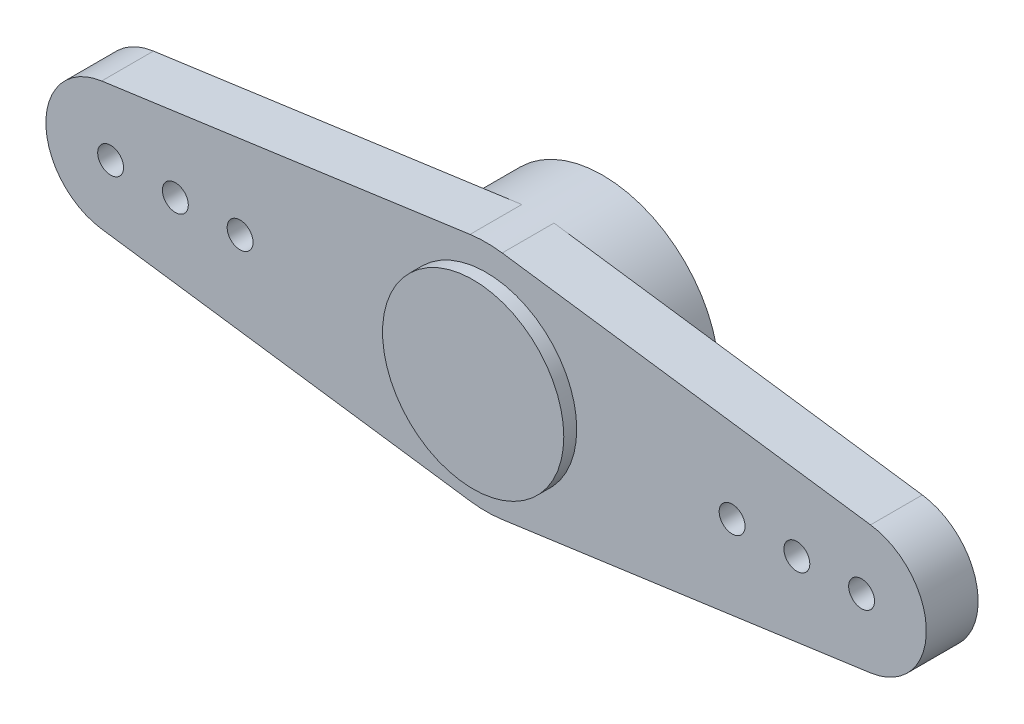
from build123d import *

# Parameters (mm, degrees)
ESQUISSE1_R      = 0.5
EXTRUSION6_DEPTH = 2
ESQUISSE2_R      = 3.5
EXTRUSION7_DEPTH = 0.5
EXTRUSION8_START = 2.5
ESQUISSE3_R      = 4.5
EXTRUSION8_DEPTH = 2.5
ESQUISSE4_R      = 2.9
EXTRUSION9_DEPTH = 2.7


with BuildPart() as part:
    # Esquisse1 → Extrusion6 (new body)
    with BuildSketch(Plane.XY):
        with BuildLine():
            Line((-14.844827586, 2.476104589), (-0.620689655, 4.45698826))
            ThreePointArc((-0.620689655, 4.45698826), (0, 4.5), (0.620689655, 4.45698826))
            Line((0.620689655, 4.45698826), (14.844827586, 2.476104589))
            ThreePointArc((14.844827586, 2.476104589), (17, 0), (14.844827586, -2.476104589))
            Line((14.844827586, -2.476104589), (0.620689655, -4.45698826))
            ThreePointArc((0.620689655, -4.45698826), (0, -4.5), (-0.620689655, -4.45698826))
            Line((-0.620689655, -4.45698826), (-14.844827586, -2.476104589))
            ThreePointArc((-14.844827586, -2.476104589), (-17, 0), (-14.844827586, 2.476104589))
        make_face()
        with Locations((-14.5, 0)):
            Circle(ESQUISSE1_R, mode=Mode.SUBTRACT)
        with Locations((-12, 0)):
            Circle(ESQUISSE1_R, mode=Mode.SUBTRACT)
        with Locations((-9.5, 0)):
            Circle(ESQUISSE1_R, mode=Mode.SUBTRACT)
        with Locations((9.5, 0)):
            Circle(ESQUISSE1_R, mode=Mode.SUBTRACT)
        with Locations((12, 0)):
            Circle(ESQUISSE1_R, mode=Mode.SUBTRACT)
        with Locations((14.5, 0)):
            Circle(ESQUISSE1_R, mode=Mode.SUBTRACT)
    extrude(amount=EXTRUSION6_DEPTH)

    # Esquisse2 → Extrusion7 (add)
    with BuildSketch(Plane.XY.offset(2)):
        Circle(ESQUISSE2_R)
    extrude(amount=EXTRUSION7_DEPTH)

    # Esquisse3 → Extrusion8 (add)
    with BuildSketch(Plane(origin=(0, 0, 0), x_dir=(-1, 0, 0), z_dir=(0, 0, -1)).offset(EXTRUSION8_START)):
        Circle(ESQUISSE3_R)
    extrude(amount=-EXTRUSION8_DEPTH)

    # Esquisse4 → Extrusion9 (cut)
    with BuildSketch(Plane(origin=(0, 0, -2.5), x_dir=(-1, 0, 0), z_dir=(0, 0, -1))):
        Circle(ESQUISSE4_R)
    extrude(amount=-EXTRUSION9_DEPTH, mode=Mode.SUBTRACT)


solid = part.part
